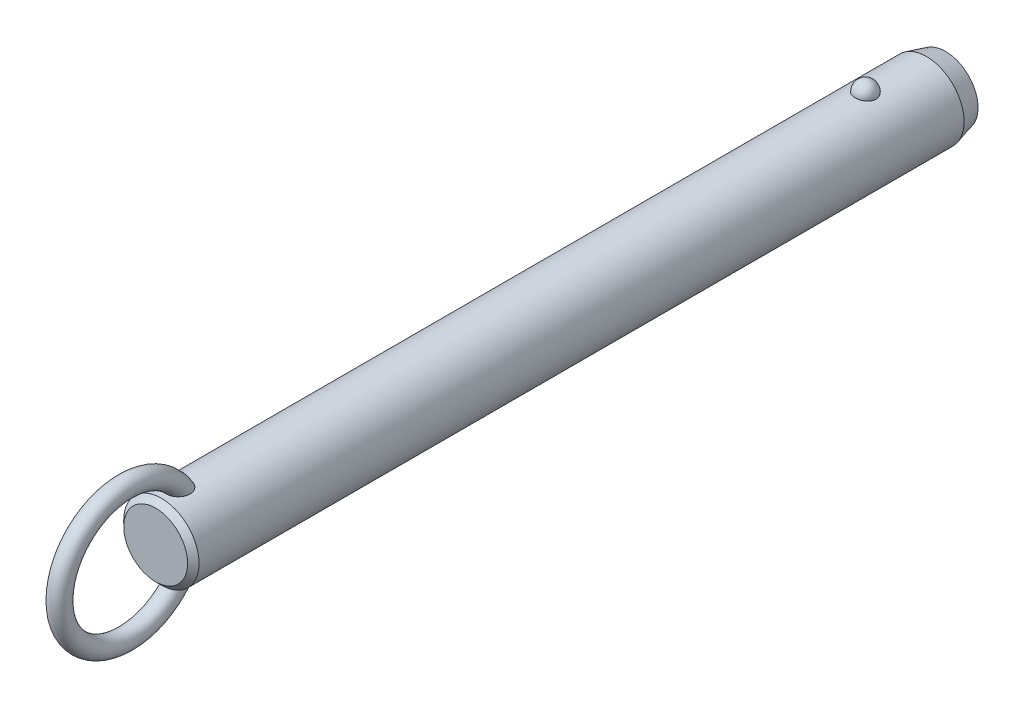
ISO-10303-21;
HEADER;
FILE_DESCRIPTION(('STEP AP214'),'2;1');
FILE_NAME('part.step','',(''),(''),'','','');
FILE_SCHEMA(('AUTOMOTIVE_DESIGN { 1 0 10303 214 1 1 1 1 }'));
ENDSEC;
DATA;
#1=APPLICATION_CONTEXT('core data for automotive mechanical design processes');
#2=APPLICATION_PROTOCOL_DEFINITION('international standard','automotive_design',2000,#1);
#3=PRODUCT_CONTEXT('',#1,'mechanical');
#4=PRODUCT('Part','Part','',(#3));
#5=PRODUCT_RELATED_PRODUCT_CATEGORY('part','',(#4));
#6=PRODUCT_DEFINITION_FORMATION('','',#4);
#7=PRODUCT_DEFINITION_CONTEXT('part definition',#1,'design');
#8=PRODUCT_DEFINITION('design','',#6,#7);
#9=PRODUCT_DEFINITION_SHAPE('','',#8);
#10=(LENGTH_UNIT() NAMED_UNIT(*) SI_UNIT(.MILLI.,.METRE.));
#11=(NAMED_UNIT(*) PLANE_ANGLE_UNIT() SI_UNIT($,.RADIAN.));
#12=(NAMED_UNIT(*) SI_UNIT($,.STERADIAN.) SOLID_ANGLE_UNIT());
#13=UNCERTAINTY_MEASURE_WITH_UNIT(LENGTH_MEASURE(1.E-05),#10,'distance_accuracy_value','');
#14=(GEOMETRIC_REPRESENTATION_CONTEXT(3) GLOBAL_UNCERTAINTY_ASSIGNED_CONTEXT((#13)) GLOBAL_UNIT_ASSIGNED_CONTEXT((#10,
#11,#12)) REPRESENTATION_CONTEXT('',''));
#15=CARTESIAN_POINT('',(0.,0.,0.));
#16=DIRECTION('',(0.,0.,1.));
#17=DIRECTION('',(1.,0.,0.));
#18=AXIS2_PLACEMENT_3D('',#15,#16,#17);
#19=CARTESIAN_POINT('',(0.,0.,137.2));
#20=DIRECTION('',(0.,0.,-1.));
#21=DIRECTION('',(-1.,0.,0.));
#22=AXIS2_PLACEMENT_3D('',#19,#20,#21);
#23=CYLINDRICAL_SURFACE('',#22,7.9);
#24=CARTESIAN_POINT('',(2.1785689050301,7.59367088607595,-2.19999999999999));
#25=CARTESIAN_POINT('',(2.17856679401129,7.59367269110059,-2.07701843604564));
#26=CARTESIAN_POINT('',(2.16853481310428,7.59657145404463,-1.95401006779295));
#27=CARTESIAN_POINT('',(2.12864689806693,7.607843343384,-1.71147811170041));
#28=CARTESIAN_POINT('',(2.09878338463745,7.61621856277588,-1.59195587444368));
#29=CARTESIAN_POINT('',(2.0199931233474,7.63749180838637,-1.3598563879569));
#30=CARTESIAN_POINT('',(1.97107475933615,7.6503878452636,-1.24727610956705));
#31=CARTESIAN_POINT('',(1.85539377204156,7.67926115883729,-1.03213234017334));
#32=CARTESIAN_POINT('',(1.78863158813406,7.69523835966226,-0.929568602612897));
#33=CARTESIAN_POINT('',(1.63856494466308,7.7285848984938,-0.736786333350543));
#34=CARTESIAN_POINT('',(1.55518140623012,7.7459606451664,-0.646630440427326));
#35=CARTESIAN_POINT('',(1.37422937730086,7.78009978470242,-0.481747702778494));
#36=CARTESIAN_POINT('',(1.27666086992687,7.79686317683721,-0.407020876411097));
#37=CARTESIAN_POINT('',(1.07024728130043,7.82786153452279,-0.275278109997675));
#38=CARTESIAN_POINT('',(0.961434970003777,7.84210353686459,-0.218212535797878));
#39=CARTESIAN_POINT('',(0.735351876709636,7.86652194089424,-0.123146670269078));
#40=CARTESIAN_POINT('',(0.618082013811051,7.87669878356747,-0.085144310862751));
#41=CARTESIAN_POINT('',(0.380637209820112,7.89170521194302,-0.0298158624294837));
#42=CARTESIAN_POINT('',(0.260550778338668,7.89662650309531,-0.0121347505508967));
#43=CARTESIAN_POINT('',(0.0190117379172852,7.90090003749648,0.00324379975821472));
#44=CARTESIAN_POINT('',(-0.102440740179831,7.90025280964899,0.00094313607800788));
#45=CARTESIAN_POINT('',(-0.341452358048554,7.89351056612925,-0.0233955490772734));
#46=CARTESIAN_POINT('',(-0.459042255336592,7.88749257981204,-0.0451545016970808));
#47=CARTESIAN_POINT('',(-0.688796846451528,7.87075812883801,-0.107408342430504));
#48=CARTESIAN_POINT('',(-0.800961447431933,7.86004158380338,-0.147903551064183));
#49=CARTESIAN_POINT('',(-1.01743634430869,7.83497131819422,-0.246799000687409));
#50=CARTESIAN_POINT('',(-1.12169791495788,7.82059709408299,-0.305300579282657));
#51=CARTESIAN_POINT('',(-1.31891765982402,7.78976470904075,-0.438549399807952));
#52=CARTESIAN_POINT('',(-1.41187469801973,7.77330633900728,-0.513298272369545));
#53=CARTESIAN_POINT('',(-1.58577142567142,7.73972434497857,-0.678622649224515));
#54=CARTESIAN_POINT('',(-1.66645140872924,7.72259402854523,-0.769470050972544));
#55=CARTESIAN_POINT('',(-1.81161503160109,7.68983776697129,-0.963538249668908));
#56=CARTESIAN_POINT('',(-1.87609753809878,7.6742119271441,-1.06675991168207));
#57=CARTESIAN_POINT('',(-1.98790138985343,7.6460202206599,-1.28401170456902));
#58=CARTESIAN_POINT('',(-2.03501994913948,7.63349104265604,-1.39815107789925));
#59=CARTESIAN_POINT('',(-2.10986724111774,7.6131449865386,-1.63301784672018));
#60=CARTESIAN_POINT('',(-2.1375965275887,7.60532797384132,-1.75374505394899));
#61=CARTESIAN_POINT('',(-2.17289256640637,7.5953195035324,-1.99782562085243));
#62=CARTESIAN_POINT('',(-2.18054294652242,7.59310471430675,-2.12116592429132));
#63=CARTESIAN_POINT('',(-2.17572919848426,7.59448538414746,-2.36741799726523));
#64=CARTESIAN_POINT('',(-2.1632656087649,7.59808068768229,-2.49032977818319));
#65=CARTESIAN_POINT('',(-2.11865035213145,7.61064035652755,-2.73161015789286));
#66=CARTESIAN_POINT('',(-2.08659579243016,7.61957823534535,-2.84999812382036));
#67=CARTESIAN_POINT('',(-2.00367799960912,7.64179982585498,-3.07955956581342));
#68=CARTESIAN_POINT('',(-1.9528140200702,7.65508371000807,-3.19073275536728));
#69=CARTESIAN_POINT('',(-1.83321113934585,7.68460381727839,-3.40337899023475));
#70=CARTESIAN_POINT('',(-1.76437735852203,7.70085556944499,-3.50479651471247));
#71=CARTESIAN_POINT('',(-1.61069526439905,7.73445734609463,-3.69446912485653));
#72=CARTESIAN_POINT('',(-1.52584634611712,7.75180741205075,-3.78272371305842));
#73=CARTESIAN_POINT('',(-1.34198059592,7.78574608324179,-3.94393987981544));
#74=CARTESIAN_POINT('',(-1.24291308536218,7.80233167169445,-4.01684434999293));
#75=CARTESIAN_POINT('',(-1.03352039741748,7.83281625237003,-4.14489386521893));
#76=CARTESIAN_POINT('',(-0.92319600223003,7.84671543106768,-4.20004014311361));
#77=CARTESIAN_POINT('',(-0.695822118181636,7.87011575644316,-4.29042017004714));
#78=CARTESIAN_POINT('',(-0.578872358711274,7.87966903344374,-4.32589112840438));
#79=CARTESIAN_POINT('',(-0.340410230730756,7.8935652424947,-4.37692226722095));
#80=CARTESIAN_POINT('',(-0.218898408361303,7.89790879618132,-4.39248482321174));
#81=CARTESIAN_POINT('',(0.0228107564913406,7.90087453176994,-4.40314405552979));
#82=CARTESIAN_POINT('',(0.142990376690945,7.89960185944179,-4.39861683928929));
#83=CARTESIAN_POINT('',(0.380829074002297,7.89171262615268,-4.37008293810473));
#84=CARTESIAN_POINT('',(0.498488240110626,7.8850962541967,-4.34607694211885));
#85=CARTESIAN_POINT('',(0.727535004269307,7.86726442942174,-4.27939317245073));
#86=CARTESIAN_POINT('',(0.838944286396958,7.85606616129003,-4.236785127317));
#87=CARTESIAN_POINT('',(1.05295421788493,7.83025654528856,-4.13408348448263));
#88=CARTESIAN_POINT('',(1.15555431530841,7.81564498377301,-4.07398879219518));
#89=CARTESIAN_POINT('',(1.35076763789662,7.7843022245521,-3.93687432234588));
#90=CARTESIAN_POINT('',(1.4432046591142,7.76754209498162,-3.85961036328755));
#91=CARTESIAN_POINT('',(1.6139111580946,7.73387857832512,-3.69076949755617));
#92=CARTESIAN_POINT('',(1.6921781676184,7.71697516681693,-3.59919010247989));
#93=CARTESIAN_POINT('',(1.83380875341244,7.6845643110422,-3.40247278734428));
#94=CARTESIAN_POINT('',(1.89689280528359,7.66908588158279,-3.29712873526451));
#95=CARTESIAN_POINT('',(2.0047823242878,7.64159441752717,-3.07707931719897));
#96=CARTESIAN_POINT('',(2.0495945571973,7.62958010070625,-2.96237743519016));
#97=CARTESIAN_POINT('',(2.11580183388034,7.61146617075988,-2.74040519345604));
#98=CARTESIAN_POINT('',(2.13929812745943,7.60484503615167,-2.63379846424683));
#99=CARTESIAN_POINT('',(2.17068242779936,7.59594664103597,-2.41813481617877));
#100=CARTESIAN_POINT('',(2.17857077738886,7.59366928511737,-2.30907795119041));
#101=CARTESIAN_POINT('',(2.1785689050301,7.59367088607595,-2.19999999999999));
#102=B_SPLINE_CURVE_WITH_KNOTS('',3,(#24,#25,#26,#27,#28,#29,#30,#31,#32,#33,#34,#35,#36,#37,
#38,#39,#40,#41,#42,#43,#44,#45,#46,#47,#48,#49,#50,#51,#52,#53,#54,#55,#56,#57,#58,#59,#60,#61,
#62,#63,#64,#65,#66,#67,#68,#69,#70,#71,#72,#73,#74,#75,#76,#77,#78,#79,#80,#81,#82,#83,#84,#85,
#86,#87,#88,#89,#90,#91,#92,#93,#94,#95,#96,#97,#98,#99,#100,#101),.UNSPECIFIED.,.T.,.F.,(4,2,2,
2,2,2,2,2,2,2,2,2,2,2,2,2,2,2,2,2,2,2,2,2,2,2,2,2,2,2,2,2,2,2,2,2,2,2,4),(0.,0.368552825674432,
0.737246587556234,1.10577831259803,1.4743009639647,1.8446206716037,2.21494081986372,
2.5842105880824,2.95344028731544,3.31611630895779,3.67875788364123,4.03628044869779,
4.39380913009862,4.75338791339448,5.11300280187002,5.47939989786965,5.8458226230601,
6.21639834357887,6.58696347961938,6.95598276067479,7.32499216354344,7.69218715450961,
8.0593967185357,8.42858578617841,8.79778880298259,9.16834203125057,9.5388695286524,
9.90482699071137,10.2707407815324,10.6298333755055,10.9889132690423,11.3466585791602,
11.7044262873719,12.0676511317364,12.4309391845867,12.8004764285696,13.1698767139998,
13.4967701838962,13.8236564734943),.UNSPECIFIED.);
#103=CARTESIAN_POINT('',(2.1785689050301,7.59367088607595,-2.19999999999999));
#104=VERTEX_POINT('',#103);
#105=EDGE_CURVE('E41',#104,#104,#102,.T.);
#106=ORIENTED_EDGE('',*,*,#105,.T.);
#107=EDGE_LOOP('',(#106));
#108=FACE_BOUND('',#107,.T.);
#109=CARTESIAN_POINT('',(0.,0.,145.52));
#110=DIRECTION('',(0.,0.,1.));
#111=DIRECTION('',(1.,0.,0.));
#112=AXIS2_PLACEMENT_3D('',#109,#110,#111);
#113=CIRCLE('',#112,7.9);
#114=CARTESIAN_POINT('',(7.9,0.,145.52));
#115=VERTEX_POINT('',#114);
#116=EDGE_CURVE('E10',#115,#115,#113,.F.);
#117=ORIENTED_EDGE('',*,*,#116,.T.);
#118=EDGE_LOOP('',(#117));
#119=FACE_BOUND('',#118,.T.);
#120=CARTESIAN_POINT('',(-0.630969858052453,-7.87476203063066,139.412432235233));
#121=CARTESIAN_POINT('',(-0.734180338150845,-7.86648998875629,139.447285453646));
#122=CARTESIAN_POINT('',(-0.834476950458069,-7.85639291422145,139.490816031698));
#123=CARTESIAN_POINT('',(-1.0262035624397,-7.83366343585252,139.594094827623));
#124=CARTESIAN_POINT('',(-1.1176141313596,-7.82102565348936,139.653877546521));
#125=CARTESIAN_POINT('',(-1.28877277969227,-7.79464922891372,139.787839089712));
#126=CARTESIAN_POINT('',(-1.36854014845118,-7.78091246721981,139.861993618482));
#127=CARTESIAN_POINT('',(-1.5146152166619,-7.75380398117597,140.022494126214));
#128=CARTESIAN_POINT('',(-1.58092966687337,-7.74043207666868,140.108833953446));
#129=CARTESIAN_POINT('',(-1.70019064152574,-7.7151252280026,140.292978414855));
#130=CARTESIAN_POINT('',(-1.75284037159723,-7.70322473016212,140.390979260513));
#131=CARTESIAN_POINT('',(-1.84263464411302,-7.68224112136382,140.594102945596));
#132=CARTESIAN_POINT('',(-1.87977299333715,-7.6731591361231,140.699228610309));
#133=CARTESIAN_POINT('',(-1.94152728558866,-7.65777930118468,140.923284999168));
#134=CARTESIAN_POINT('',(-1.96475471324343,-7.65179654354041,141.042616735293));
#135=CARTESIAN_POINT('',(-1.99449499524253,-7.64409642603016,141.28342986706));
#136=CARTESIAN_POINT('',(-2.0010005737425,-7.64238092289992,141.404912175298));
#137=CARTESIAN_POINT('',(-1.99856014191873,-7.64302120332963,141.668340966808));
#138=CARTESIAN_POINT('',(-1.98680021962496,-7.64611845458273,141.81025654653));
#139=CARTESIAN_POINT('',(-1.94457772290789,-7.65696186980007,142.091118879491));
#140=CARTESIAN_POINT('',(-1.91409393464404,-7.66471330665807,142.230062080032));
#141=CARTESIAN_POINT('',(-1.82768670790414,-7.68582947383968,142.531939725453));
#142=CARTESIAN_POINT('',(-1.76772963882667,-7.70003779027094,142.693686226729));
#143=CARTESIAN_POINT('',(-1.65998501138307,-7.72371550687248,142.927695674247));
#144=CARTESIAN_POINT('',(-1.621079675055,-7.73200670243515,143.004297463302));
#145=CARTESIAN_POINT('',(-1.53727726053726,-7.74910377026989,143.154079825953));
#146=CARTESIAN_POINT('',(-1.49238215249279,-7.75790947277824,143.227261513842));
#147=CARTESIAN_POINT('',(-1.37397050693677,-7.77993338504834,143.40288382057));
#148=CARTESIAN_POINT('',(-1.29690364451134,-7.79328473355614,143.502955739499));
#149=CARTESIAN_POINT('',(-1.12885487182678,-7.81939266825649,143.690714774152));
#150=CARTESIAN_POINT('',(-1.03789926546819,-7.83215032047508,143.778424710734));
#151=CARTESIAN_POINT('',(-0.869532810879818,-7.85231710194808,143.913414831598));
#152=CARTESIAN_POINT('',(-0.795716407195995,-7.86021093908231,143.965076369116));
#153=CARTESIAN_POINT('',(-0.640813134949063,-7.87434920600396,144.056381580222));
#154=CARTESIAN_POINT('',(-0.559737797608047,-7.88059619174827,144.09604389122));
#155=CARTESIAN_POINT('',(-0.406456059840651,-7.88984116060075,144.154300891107));
#156=CARTESIAN_POINT('',(-0.335227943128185,-7.89321892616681,144.175384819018));
#157=CARTESIAN_POINT('',(-0.190193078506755,-7.89804235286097,144.20541418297));
#158=CARTESIAN_POINT('',(-0.116388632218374,-7.89948969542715,144.214370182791));
#159=CARTESIAN_POINT('',(0.0318414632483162,-7.90028409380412,144.219291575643));
#160=CARTESIAN_POINT('',(0.106268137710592,-7.89962640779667,144.215227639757));
#161=CARTESIAN_POINT('',(0.253290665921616,-7.8962818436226,144.194461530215));
#162=CARTESIAN_POINT('',(0.325885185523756,-7.8935935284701,144.177750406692));
#163=CARTESIAN_POINT('',(0.481441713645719,-7.88577340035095,144.128738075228));
#164=CARTESIAN_POINT('',(0.563611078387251,-7.88026321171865,144.094005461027));
#165=CARTESIAN_POINT('',(0.721129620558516,-7.86741729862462,144.011796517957));
#166=CARTESIAN_POINT('',(0.79646633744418,-7.86007832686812,143.964297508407));
#167=CARTESIAN_POINT('',(0.971456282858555,-7.84073285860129,143.836513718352));
#168=CARTESIAN_POINT('',(1.06719686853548,-7.82809461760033,143.751004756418));
#169=CARTESIAN_POINT('',(1.24418921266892,-7.80192439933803,143.566232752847));
#170=CARTESIAN_POINT('',(1.32540832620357,-7.78839049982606,143.466939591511));
#171=CARTESIAN_POINT('',(1.45199971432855,-7.76559693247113,143.289576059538));
#172=CARTESIAN_POINT('',(1.50085649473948,-7.75626094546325,143.213954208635));
#173=CARTESIAN_POINT('',(1.59197749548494,-7.73807279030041,143.058742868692));
#174=CARTESIAN_POINT('',(1.63423919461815,-7.72922080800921,142.979151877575));
#175=CARTESIAN_POINT('',(1.71222612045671,-7.71231959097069,142.816664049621));
#176=CARTESIAN_POINT('',(1.74794516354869,-7.70427111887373,142.733764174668));
#177=CARTESIAN_POINT('',(1.81270113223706,-7.68929240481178,142.565296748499));
#178=CARTESIAN_POINT('',(1.84173789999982,-7.68236218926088,142.479729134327));
#179=CARTESIAN_POINT('',(1.89322698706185,-7.6698375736,142.30528702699));
#180=CARTESIAN_POINT('',(1.91558744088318,-7.66426199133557,142.216383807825));
#181=CARTESIAN_POINT('',(1.95281367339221,-7.65485915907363,142.036969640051));
#182=CARTESIAN_POINT('',(1.96767946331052,-7.65103190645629,141.946458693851));
#183=CARTESIAN_POINT('',(2.0002145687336,-7.64262981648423,141.673732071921));
#184=CARTESIAN_POINT('',(2.00600691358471,-7.6410871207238,141.489709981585));
#185=CARTESIAN_POINT('',(1.98445334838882,-7.64669564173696,141.176501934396));
#186=CARTESIAN_POINT('',(1.96607186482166,-7.65149688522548,141.046618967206));
#187=CARTESIAN_POINT('',(1.90884967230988,-7.66597624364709,140.791632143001));
#188=CARTESIAN_POINT('',(1.87002101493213,-7.67565148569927,140.666525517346));
#189=CARTESIAN_POINT('',(1.77063986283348,-7.69918471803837,140.42454013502));
#190=CARTESIAN_POINT('',(1.70993724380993,-7.71307150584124,140.307725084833));
#191=CARTESIAN_POINT('',(1.56733070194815,-7.74330306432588,140.088144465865));
#192=CARTESIAN_POINT('',(1.48543692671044,-7.75964665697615,139.985372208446));
#193=CARTESIAN_POINT('',(1.31346177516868,-7.79047523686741,139.809380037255));
#194=CARTESIAN_POINT('',(1.22547278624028,-7.80495298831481,139.734106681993));
#195=CARTESIAN_POINT('',(1.03724352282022,-7.83218597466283,139.600486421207));
#196=CARTESIAN_POINT('',(0.93700840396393,-7.84494192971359,139.542132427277));
#197=CARTESIAN_POINT('',(0.733599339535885,-7.86649045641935,139.447027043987));
#198=CARTESIAN_POINT('',(0.630941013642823,-7.87547134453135,139.409210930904));
#199=CARTESIAN_POINT('',(0.420465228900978,-7.88950708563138,139.351116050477));
#200=CARTESIAN_POINT('',(0.312645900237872,-7.89456050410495,139.33084369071));
#201=CARTESIAN_POINT('',(0.0960869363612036,-7.9001518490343,139.308455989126));
#202=CARTESIAN_POINT('',(-0.0126341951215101,-7.90073226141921,139.306169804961));
#203=CARTESIAN_POINT('',(-0.228766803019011,-7.89742350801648,139.319367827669));
#204=CARTESIAN_POINT('',(-0.336180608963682,-7.89354403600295,139.334813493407));
#205=CARTESIAN_POINT('',(-0.473410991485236,-7.88586871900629,139.366217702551));
#206=CARTESIAN_POINT('',(-0.50525779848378,-7.88388984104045,139.374354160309));
#207=CARTESIAN_POINT('',(-0.56848128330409,-7.87958326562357,139.392208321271));
#208=CARTESIAN_POINT('',(-0.59985795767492,-7.87725556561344,139.401926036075));
#209=CARTESIAN_POINT('',(-0.630969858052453,-7.87476203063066,139.412432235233));
#210=B_SPLINE_CURVE_WITH_KNOTS('',3,(#120,#121,#122,#123,#124,#125,#126,#127,#128,#129,#130,
#131,#132,#133,#134,#135,#136,#137,#138,#139,#140,#141,#142,#143,#144,#145,#146,#147,#148,#149,
#150,#151,#152,#153,#154,#155,#156,#157,#158,#159,#160,#161,#162,#163,#164,#165,#166,#167,#168,
#169,#170,#171,#172,#173,#174,#175,#176,#177,#178,#179,#180,#181,#182,#183,#184,#185,#186,#187,
#188,#189,#190,#191,#192,#193,#194,#195,#196,#197,#198,#199,#200,#201,#202,#203,#204,#205,#206,
#207,#208,#209),.UNSPECIFIED.,.T.,.F.,(4,2,2,2,2,2,2,2,2,2,2,2,2,2,2,2,2,2,2,2,2,2,2,2,2,2,2,2,
2,2,2,2,2,2,2,2,2,2,2,2,2,2,2,2,4),(0.,0.327622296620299,0.655945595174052,0.983718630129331,
1.31132677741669,1.64554655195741,1.97989964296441,2.34365728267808,2.70757317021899,
3.13333684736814,3.5595838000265,4.07655306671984,4.33527897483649,4.59391999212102,
4.97382437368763,5.353017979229,5.62348245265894,5.89352465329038,6.11565959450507,
6.33760092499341,6.56004255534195,6.78264174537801,7.04930844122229,7.31645206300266,
7.70130871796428,8.08701995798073,8.35824509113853,8.6295736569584,8.90115735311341,
9.1727474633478,9.44791855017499,9.72308922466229,10.2715298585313,10.6638393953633,
11.0559179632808,11.4507403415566,11.8453740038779,12.1936425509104,12.5417649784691,
12.8695063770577,13.1973674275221,13.5221104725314,13.8461490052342,13.9449071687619,
14.0436660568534),.UNSPECIFIED.);
#211=CARTESIAN_POINT('',(-0.630969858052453,-7.87476203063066,139.412432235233));
#212=VERTEX_POINT('',#211);
#213=EDGE_CURVE('E59',#212,#212,#210,.T.);
#214=ORIENTED_EDGE('',*,*,#213,.T.);
#215=EDGE_LOOP('',(#214));
#216=FACE_BOUND('',#215,.T.);
#217=CARTESIAN_POINT('',(-0.630969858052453,7.87476203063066,139.412432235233));
#218=CARTESIAN_POINT('',(-0.528918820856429,7.88293636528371,139.377979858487));
#219=CARTESIAN_POINT('',(-0.423745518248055,7.88934810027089,139.351915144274));
#220=CARTESIAN_POINT('',(-0.210236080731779,7.8979273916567,139.317282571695));
#221=CARTESIAN_POINT('',(-0.10189380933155,7.90008607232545,139.308751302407));
#222=CARTESIAN_POINT('',(0.114660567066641,7.89990877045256,139.309457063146));
#223=CARTESIAN_POINT('',(0.222872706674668,7.89757640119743,139.31867980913));
#224=CARTESIAN_POINT('',(0.436107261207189,7.88867538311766,139.354652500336));
#225=CARTESIAN_POINT('',(0.541131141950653,7.8821087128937,139.38139425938));
#226=CARTESIAN_POINT('',(0.745085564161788,7.86545130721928,139.451756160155));
#227=CARTESIAN_POINT('',(0.844015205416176,7.85536005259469,139.495378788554));
#228=CARTESIAN_POINT('',(1.03299167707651,7.83275153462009,139.598379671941));
#229=CARTESIAN_POINT('',(1.12303841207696,7.8202342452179,139.657758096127));
#230=CARTESIAN_POINT('',(1.29214734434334,7.79408219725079,139.790864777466));
#231=CARTESIAN_POINT('',(1.37116907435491,7.78044359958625,139.864643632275));
#232=CARTESIAN_POINT('',(1.51597677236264,7.75353170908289,140.024235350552));
#233=CARTESIAN_POINT('',(1.58176261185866,7.74025841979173,140.110048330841));
#234=CARTESIAN_POINT('',(1.70057386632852,7.71504069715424,140.293644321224));
#235=CARTESIAN_POINT('',(1.75320073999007,7.7031425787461,140.391690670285));
#236=CARTESIAN_POINT('',(1.8429376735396,7.68216822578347,140.594893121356));
#237=CARTESIAN_POINT('',(1.88004278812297,7.67309289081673,140.700051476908));
#238=CARTESIAN_POINT('',(1.9417232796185,7.6577294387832,140.924167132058));
#239=CARTESIAN_POINT('',(1.96491037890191,7.65175648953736,141.043524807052));
#240=CARTESIAN_POINT('',(1.9945689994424,7.64407702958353,141.284384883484));
#241=CARTESIAN_POINT('',(2.00103304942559,7.64237242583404,141.40588821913));
#242=CARTESIAN_POINT('',(1.99850166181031,7.64303650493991,141.669368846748));
#243=CARTESIAN_POINT('',(1.98669038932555,7.64614714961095,141.811314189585));
#244=CARTESIAN_POINT('',(1.94436120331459,7.65701701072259,142.092228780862));
#245=CARTESIAN_POINT('',(1.91382203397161,7.66478150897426,142.231194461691));
#246=CARTESIAN_POINT('',(1.82728754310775,7.68592483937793,142.533111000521));
#247=CARTESIAN_POINT('',(1.76725778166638,7.70014685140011,142.694872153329));
#248=CARTESIAN_POINT('',(1.65939700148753,7.72384204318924,142.928891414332));
#249=CARTESIAN_POINT('',(1.62045187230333,7.73213852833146,143.005494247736));
#250=CARTESIAN_POINT('',(1.5365668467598,7.74924489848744,143.155273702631));
#251=CARTESIAN_POINT('',(1.49162892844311,7.75805461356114,143.228451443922));
#252=CARTESIAN_POINT('',(1.37317698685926,7.78007342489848,143.403952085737));
#253=CARTESIAN_POINT('',(1.29612360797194,7.79341423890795,143.503911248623));
#254=CARTESIAN_POINT('',(1.12812043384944,7.81949839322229,143.69145083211));
#255=CARTESIAN_POINT('',(1.03719688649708,7.83224280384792,143.779054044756));
#256=CARTESIAN_POINT('',(0.868871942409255,7.85239026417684,143.91389715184));
#257=CARTESIAN_POINT('',(0.795056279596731,7.86027769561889,143.965511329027));
#258=CARTESIAN_POINT('',(0.640160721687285,7.87440222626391,144.056720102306));
#259=CARTESIAN_POINT('',(0.559092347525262,7.88064188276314,144.096333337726));
#260=CARTESIAN_POINT('',(0.405820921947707,7.8898738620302,144.154505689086));
#261=CARTESIAN_POINT('',(0.334594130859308,7.89324577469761,144.175552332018));
#262=CARTESIAN_POINT('',(0.189568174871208,7.89805733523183,144.205507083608));
#263=CARTESIAN_POINT('',(0.115771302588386,7.89949866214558,144.214425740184));
#264=CARTESIAN_POINT('',(-0.0324359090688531,7.90028156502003,144.21927589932));
#265=CARTESIAN_POINT('',(-0.106847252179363,7.89961843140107,144.215178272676));
#266=CARTESIAN_POINT('',(-0.253834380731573,7.8962642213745,144.194351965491));
#267=CARTESIAN_POINT('',(-0.326408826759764,7.89357170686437,144.177614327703));
#268=CARTESIAN_POINT('',(-0.481962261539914,7.88574179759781,144.128539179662));
#269=CARTESIAN_POINT('',(-0.564145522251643,7.88022507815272,144.093763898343));
#270=CARTESIAN_POINT('',(-0.721685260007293,7.86736646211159,144.011468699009));
#271=CARTESIAN_POINT('',(-0.797029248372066,7.8600213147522,143.963926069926));
#272=CARTESIAN_POINT('',(-0.972044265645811,7.84066026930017,143.836026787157));
#273=CARTESIAN_POINT('',(-1.0677980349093,7.828012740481,143.750443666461));
#274=CARTESIAN_POINT('',(-1.24480531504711,7.80182621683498,143.565522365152));
#275=CARTESIAN_POINT('',(-1.32602618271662,7.78828530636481,143.466154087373));
#276=CARTESIAN_POINT('',(-1.45259834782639,7.76548487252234,143.288680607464));
#277=CARTESIAN_POINT('',(-1.50143856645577,7.75614818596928,143.213025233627));
#278=CARTESIAN_POINT('',(-1.59252410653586,7.73796020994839,143.057748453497));
#279=CARTESIAN_POINT('',(-1.63476690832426,7.72910910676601,142.978125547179));
#280=CARTESIAN_POINT('',(-1.71271318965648,7.71221133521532,142.815575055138));
#281=CARTESIAN_POINT('',(-1.74841047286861,7.70416543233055,142.732644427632));
#282=CARTESIAN_POINT('',(-1.81311929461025,7.6891937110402,142.564116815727));
#283=CARTESIAN_POINT('',(-1.84213067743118,7.68226791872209,142.478519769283));
#284=CARTESIAN_POINT('',(-1.89356259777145,7.66975461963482,142.304025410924));
#285=CARTESIAN_POINT('',(-1.91589165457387,7.66418586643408,142.215099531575));
#286=CARTESIAN_POINT('',(-1.9530507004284,7.65479859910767,142.035642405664));
#287=CARTESIAN_POINT('',(-1.96788069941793,7.65098008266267,141.945111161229));
#288=CARTESIAN_POINT('',(-2.00030078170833,7.64260704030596,141.672327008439));
#289=CARTESIAN_POINT('',(-2.00600576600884,7.64108760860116,141.488271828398));
#290=CARTESIAN_POINT('',(-1.9842848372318,7.64673945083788,141.175080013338));
#291=CARTESIAN_POINT('',(-1.96583698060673,7.65155751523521,141.045240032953));
#292=CARTESIAN_POINT('',(-1.90848948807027,7.66606613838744,140.790361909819));
#293=CARTESIAN_POINT('',(-1.86960376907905,7.67575338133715,140.665320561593));
#294=CARTESIAN_POINT('',(-1.77013421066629,7.6993013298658,140.423500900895));
#295=CARTESIAN_POINT('',(-1.70940488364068,7.71318991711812,140.306784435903));
#296=CARTESIAN_POINT('',(-1.56672953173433,7.74342495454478,140.087340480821));
#297=CARTESIAN_POINT('',(-1.48478316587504,7.75977144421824,139.98461321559));
#298=CARTESIAN_POINT('',(-1.31266325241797,7.79061163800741,139.808643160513));
#299=CARTESIAN_POINT('',(-1.22456383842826,7.80509908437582,139.733358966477));
#300=CARTESIAN_POINT('',(-1.03622400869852,7.83231881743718,139.599865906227));
#301=CARTESIAN_POINT('',(-0.936015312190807,7.84505551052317,139.541613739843));
#302=CARTESIAN_POINT('',(-0.798824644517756,7.85957802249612,139.477540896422));
#303=CARTESIAN_POINT('',(-0.765787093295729,7.86286821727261,139.463224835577));
#304=CARTESIAN_POINT('',(-0.698939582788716,7.86909211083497,139.436436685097));
#305=CARTESIAN_POINT('',(-0.66512963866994,7.8720258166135,139.423964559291));
#306=CARTESIAN_POINT('',(-0.630969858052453,7.87476203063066,139.412432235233));
#307=B_SPLINE_CURVE_WITH_KNOTS('',3,(#217,#218,#219,#220,#221,#222,#223,#224,#225,#226,#227,
#228,#229,#230,#231,#232,#233,#234,#235,#236,#237,#238,#239,#240,#241,#242,#243,#244,#245,#246,
#247,#248,#249,#250,#251,#252,#253,#254,#255,#256,#257,#258,#259,#260,#261,#262,#263,#264,#265,
#266,#267,#268,#269,#270,#271,#272,#273,#274,#275,#276,#277,#278,#279,#280,#281,#282,#283,#284,
#285,#286,#287,#288,#289,#290,#291,#292,#293,#294,#295,#296,#297,#298,#299,#300,#301,#302,#303,
#304,#305,#306),.UNSPECIFIED.,.T.,.F.,(4,2,2,2,2,2,2,2,2,2,2,2,2,2,2,2,2,2,2,2,2,2,2,2,2,2,2,2,
2,2,2,2,2,2,2,2,2,2,2,2,2,2,2,2,4),(0.,0.323920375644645,0.648516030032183,0.972850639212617,
1.29703380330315,1.62126473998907,1.94549915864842,2.27089401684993,2.5962920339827,
2.93059633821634,3.26500707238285,3.6288164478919,3.99278833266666,4.4186542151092,
4.84500434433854,5.36209210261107,5.62087589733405,5.87957448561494,6.25918598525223,
6.63808782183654,6.90846748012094,7.17842501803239,7.40052350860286,7.6224287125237,
7.84483086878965,8.06739077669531,8.33414615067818,8.60137921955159,8.98641454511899,
9.37230415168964,9.64358673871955,9.91497268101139,10.1866142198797,10.4582620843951,
10.7334745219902,11.008686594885,11.5572126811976,11.9494246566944,12.3413699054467,
12.7359755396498,13.1305875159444,13.4791770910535,13.82687259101,13.9353013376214,
14.0437279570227),.UNSPECIFIED.);
#308=CARTESIAN_POINT('',(-0.630969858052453,7.87476203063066,139.412432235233));
#309=VERTEX_POINT('',#308);
#310=EDGE_CURVE('E67',#309,#309,#307,.T.);
#311=ORIENTED_EDGE('',*,*,#310,.T.);
#312=EDGE_LOOP('',(#311));
#313=FACE_BOUND('',#312,.T.);
#314=CARTESIAN_POINT('',(0.,0.,-14.9999999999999));
#315=DIRECTION('',(0.,0.,-1.));
#316=DIRECTION('',(-1.,0.,0.));
#317=AXIS2_PLACEMENT_3D('',#314,#315,#316);
#318=CIRCLE('',#317,7.9);
#319=CARTESIAN_POINT('',(-7.9,0.,-14.9999999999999));
#320=VERTEX_POINT('',#319);
#321=EDGE_CURVE('E56',#320,#320,#318,.F.);
#322=ORIENTED_EDGE('',*,*,#321,.T.);
#323=EDGE_LOOP('',(#322));
#324=FACE_BOUND('',#323,.T.);
#325=ADVANCED_FACE('F37',(#108,#119,#216,#313,#324),#23,.T.);
#326=CARTESIAN_POINT('',(0.,0.,-19.));
#327=DIRECTION('',(0.,0.,-1.));
#328=DIRECTION('',(-1.,0.,0.));
#329=AXIS2_PLACEMENT_3D('',#326,#327,#328);
#330=PLANE('',#329);
#331=CARTESIAN_POINT('',(0.,0.,-19.));
#332=DIRECTION('',(0.,0.,-1.));
#333=DIRECTION('',(-1.,0.,0.));
#334=AXIS2_PLACEMENT_3D('',#331,#332,#333);
#335=CIRCLE('',#334,6.8282032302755);
#336=CARTESIAN_POINT('',(-6.8282032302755,0.,-19.));
#337=VERTEX_POINT('',#336);
#338=EDGE_CURVE('E66',#337,#337,#335,.T.);
#339=ORIENTED_EDGE('',*,*,#338,.T.);
#340=EDGE_LOOP('',(#339));
#341=FACE_BOUND('',#340,.T.);
#342=ADVANCED_FACE('F85',(#341),#330,.T.);
#343=CARTESIAN_POINT('',(0.,0.,-19.));
#344=DIRECTION('',(0.,0.,1.));
#345=DIRECTION('',(1.,0.,0.));
#346=AXIS2_PLACEMENT_3D('',#343,#344,#345);
#347=CONICAL_SURFACE('',#346,6.8282032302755,0.261799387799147);
#348=ORIENTED_EDGE('',*,*,#321,.F.);
#349=EDGE_LOOP('',(#348));
#350=FACE_BOUND('',#349,.T.);
#351=ORIENTED_EDGE('',*,*,#338,.F.);
#352=EDGE_LOOP('',(#351));
#353=FACE_BOUND('',#352,.T.);
#354=ADVANCED_FACE('F83',(#350,#353),#347,.T.);
#355=CARTESIAN_POINT('',(0.,0.,146.72));
#356=DIRECTION('',(0.,0.,1.));
#357=DIRECTION('',(1.,0.,0.));
#358=AXIS2_PLACEMENT_3D('',#355,#356,#357);
#359=PLANE('',#358);
#360=CARTESIAN_POINT('',(0.,0.,146.72));
#361=DIRECTION('',(0.,0.,1.));
#362=DIRECTION('',(1.,0.,0.));
#363=AXIS2_PLACEMENT_3D('',#360,#361,#362);
#364=CIRCLE('',#363,6.69999999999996);
#365=CARTESIAN_POINT('',(6.69999999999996,0.,146.72));
#366=VERTEX_POINT('',#365);
#367=EDGE_CURVE('E50',#366,#366,#364,.T.);
#368=ORIENTED_EDGE('',*,*,#367,.T.);
#369=EDGE_LOOP('',(#368));
#370=FACE_BOUND('',#369,.T.);
#371=ADVANCED_FACE('F77',(#370),#359,.T.);
#372=CARTESIAN_POINT('',(0.,0.,153.05));
#373=DIRECTION('',(1.,0.,0.));
#374=DIRECTION('',(0.,0.,-1.));
#375=AXIS2_PLACEMENT_3D('',#372,#373,#374);
#376=TOROIDAL_SURFACE('',#375,13.85,2.);
#377=ORIENTED_EDGE('',*,*,#310,.F.);
#378=EDGE_LOOP('',(#377));
#379=FACE_BOUND('',#378,.T.);
#380=ORIENTED_EDGE('',*,*,#213,.F.);
#381=EDGE_LOOP('',(#380));
#382=FACE_BOUND('',#381,.T.);
#383=ADVANCED_FACE('F73',(#379,#382),#376,.T.);
#384=CARTESIAN_POINT('',(0.,0.,146.72));
#385=DIRECTION('',(0.,0.,-1.));
#386=DIRECTION('',(-1.,0.,0.));
#387=AXIS2_PLACEMENT_3D('',#384,#385,#386);
#388=CONICAL_SURFACE('',#387,6.69999999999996,0.785398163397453);
#389=ORIENTED_EDGE('',*,*,#116,.F.);
#390=EDGE_LOOP('',(#389));
#391=FACE_BOUND('',#390,.T.);
#392=ORIENTED_EDGE('',*,*,#367,.F.);
#393=EDGE_LOOP('',(#392));
#394=FACE_BOUND('',#393,.T.);
#395=ADVANCED_FACE('F39',(#391,#394),#388,.T.);
#396=CARTESIAN_POINT('',(0.,7.9,-2.19999999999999));
#397=DIRECTION('',(0.,1.,0.));
#398=DIRECTION('',(0.,0.,-1.));
#399=AXIS2_PLACEMENT_3D('',#396,#397,#398);
#400=SPHERICAL_SURFACE('',#399,2.2);
#401=ORIENTED_EDGE('',*,*,#105,.F.);
#402=EDGE_LOOP('',(#401));
#403=FACE_BOUND('',#402,.T.);
#404=ADVANCED_FACE('F79',(#403),#400,.T.);
#405=CLOSED_SHELL('',(#325,#342,#354,#371,#383,#395,#404));
#406=MANIFOLD_SOLID_BREP('B2',#405);
#407=ADVANCED_BREP_SHAPE_REPRESENTATION('',(#18,#406),#14);
#408=SHAPE_DEFINITION_REPRESENTATION(#9,#407);
ENDSEC;
END-ISO-10303-21;
